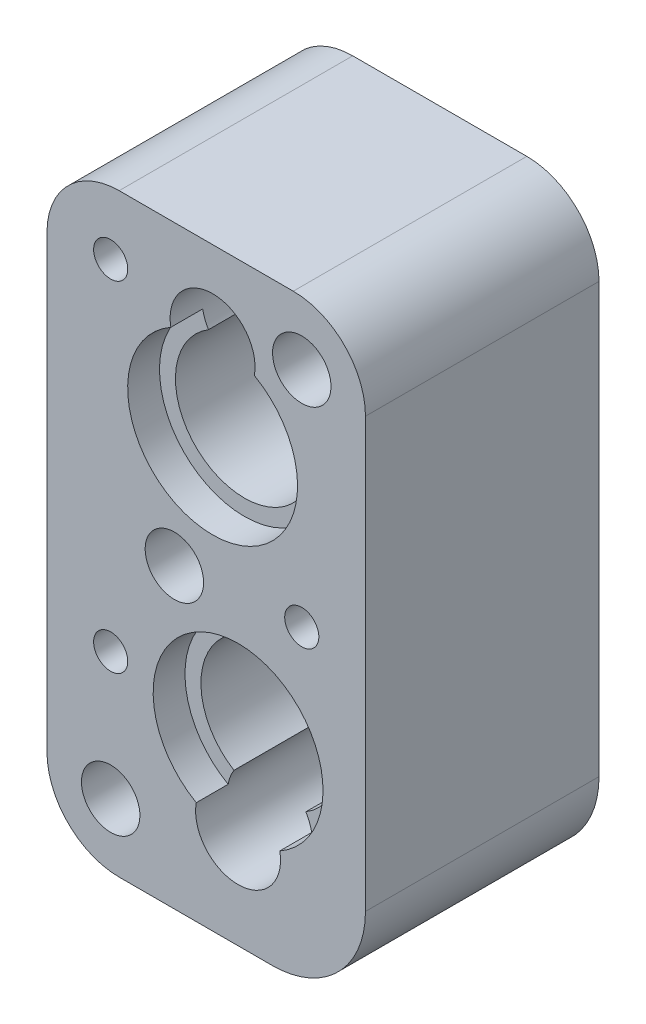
from build123d import *

# Parameters (mm, degrees)
BOSS_EXTRUDE1_DEPTH      = 3.175
BOSS_EXTRUDE1_DEPTH_BACK = 31.75
HOLE1_D                  = 12.7
HOLE11_D                 = 20.6375
HOLE11_CBORE_D           = 25.4
HOLE11_CBORE_DEPTH       = 4.7625
HOLE12_D                 = 20.6375
HOLE12_CBORE_D           = 25.4
HOLE12_CBORE_DEPTH       = 4.7625
HOLE15_D                 = 5.1054
HOLE15_DEPTH             = 34.925
HOLE15_TIP               = 1.533816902
HOLE16_D                 = 8.7376
HOLE16_CBORE_D           = 13.081
HOLE16_CBORE_DEPTH       = 9.652


with BuildPart() as part:
    # Sketch1 → Boss-Extrude1 (new, two sides: drawn at the far end of the back side and taken through both)
    with BuildSketch(Plane(origin=(0, 0, 40.2082), x_dir=(-1, 0, 0), z_dir=(0, 0, -1)).offset(-BOSS_EXTRUDE1_DEPTH_BACK)):
        with BuildLine():
            Line((121.92, 88.5952), (147.955, 88.5952))
            ThreePointArc((147.955, 88.5952), (155.588217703, 85.433417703), (158.75, 77.8002))
            Line((158.75, 77.8002), (158.75, 10.4902))
            ThreePointArc((158.75, 10.4902), (155.588217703, 2.856982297), (147.955, -0.3048))
            Line((147.955, -0.3048), (125.095, -0.3048))
            ThreePointArc((125.095, -0.3048), (115.216718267, 3.786918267), (111.125, 13.6652))
            Line((111.125, 13.6652), (111.125, 77.8002))
            ThreePointArc((111.125, 77.8002), (114.286782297, 85.433417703), (121.92, 88.5952))
        make_face()
    extrude(amount=BOSS_EXTRUDE1_DEPTH + BOSS_EXTRUDE1_DEPTH_BACK)

    # Hole1 (through all)
    with Locations(Plane(origin=(-122.710739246, 32.826140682, 37.0332), x_dir=(-1, 0, 0), z_dir=(0, 0, -1))):
        with Locations((11.274260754, 43.069059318), (7.464260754, -18.856140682)):
            Hole(HOLE1_D / 2)

    # Hole11 (through all)
    with Locations(Plane(origin=(-130.613061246, 31.781045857, 71.9582), x_dir=(1, 0, 0), z_dir=(0, 0, 1))):
        with Locations((-3.371938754, 31.922154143)):
            CounterBoreHole(HOLE11_D / 2, HOLE11_CBORE_D / 2, HOLE11_CBORE_DEPTH)

    # Hole12 (through all)
    with Locations(Plane(origin=(-103.534682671, 68.961340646, 71.9582), x_dir=(1, 0, 0), z_dir=(0, 0, 1))):
        with Locations((-26.640317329, -42.799340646)):
            CounterBoreHole(HOLE12_D / 2, HOLE12_CBORE_D / 2, HOLE12_CBORE_DEPTH)

    # Hole15
    with Locations(Plane(origin=(-140.578455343, 62.583965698, 71.9582), x_dir=(1, 0, 0), z_dir=(0, 0, 1))):
        with Locations((-8.646544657, -34.313765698), (19.928455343, -16.851265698), (-8.646544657, 16.486234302)):
            Hole(HOLE15_D / 2, depth=HOLE15_DEPTH)
            with Locations((0, 0, -(HOLE15_DEPTH + HOLE15_TIP / 2))):  # 118° drill point
                Cone(0, HOLE15_D / 2, HOLE15_TIP, mode=Mode.SUBTRACT)

    # Hole16 (through all)
    with Locations(Plane(origin=(-107.780892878, 80.005199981, 37.0332), x_dir=(-1, 0, 0), z_dir=(0, 0, -1))):
        with Locations((12.869107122, -0.934999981), (31.919107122, -35.859999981), (41.444107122, -70.784999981)):
            CounterBoreHole(HOLE16_D / 2, HOLE16_CBORE_D / 2, HOLE16_CBORE_DEPTH)


solid = part.part
